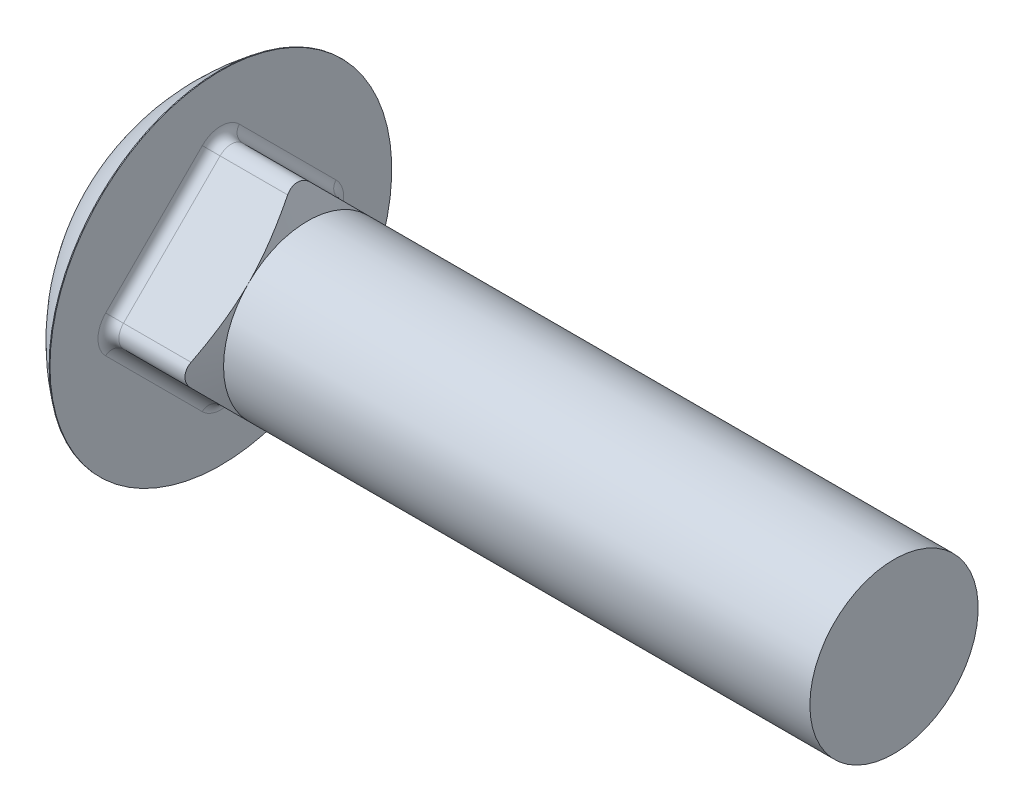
ISO-10303-21;
HEADER;
FILE_DESCRIPTION(('STEP AP214'),'2;1');
FILE_NAME('part.step','',(''),(''),'','','');
FILE_SCHEMA(('AUTOMOTIVE_DESIGN { 1 0 10303 214 1 1 1 1 }'));
ENDSEC;
DATA;
#1=APPLICATION_CONTEXT('core data for automotive mechanical design processes');
#2=APPLICATION_PROTOCOL_DEFINITION('international standard','automotive_design',2000,#1);
#3=PRODUCT_CONTEXT('',#1,'mechanical');
#4=PRODUCT('Part','Part','',(#3));
#5=PRODUCT_RELATED_PRODUCT_CATEGORY('part','',(#4));
#6=PRODUCT_DEFINITION_FORMATION('','',#4);
#7=PRODUCT_DEFINITION_CONTEXT('part definition',#1,'design');
#8=PRODUCT_DEFINITION('design','',#6,#7);
#9=PRODUCT_DEFINITION_SHAPE('','',#8);
#10=(LENGTH_UNIT() NAMED_UNIT(*) SI_UNIT(.MILLI.,.METRE.));
#11=(NAMED_UNIT(*) PLANE_ANGLE_UNIT() SI_UNIT($,.RADIAN.));
#12=(NAMED_UNIT(*) SI_UNIT($,.STERADIAN.) SOLID_ANGLE_UNIT());
#13=UNCERTAINTY_MEASURE_WITH_UNIT(LENGTH_MEASURE(1.E-05),#10,'distance_accuracy_value','');
#14=(GEOMETRIC_REPRESENTATION_CONTEXT(3) GLOBAL_UNCERTAINTY_ASSIGNED_CONTEXT((#13)) GLOBAL_UNIT_ASSIGNED_CONTEXT((#10,
#11,#12)) REPRESENTATION_CONTEXT('',''));
#15=CARTESIAN_POINT('',(0.,0.,0.));
#16=DIRECTION('',(0.,0.,1.));
#17=DIRECTION('',(1.,0.,0.));
#18=AXIS2_PLACEMENT_3D('',#15,#16,#17);
#19=CARTESIAN_POINT('',(26.2128,1.68828815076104,16.2722240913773));
#20=DIRECTION('',(0.,-0.707106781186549,-0.707106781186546));
#21=DIRECTION('',(0.,0.707106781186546,-0.707106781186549));
#22=AXIS2_PLACEMENT_3D('',#19,#20,#21);
#23=PLANE('',#22);
#24=CARTESIAN_POINT('',(24.8807598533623,16.2724240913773,1.68808815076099));
#25=CARTESIAN_POINT('',(24.9601596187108,16.027679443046,1.93283279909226));
#26=CARTESIAN_POINT('',(25.0372964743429,15.7825608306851,2.17795141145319));
#27=CARTESIAN_POINT('',(25.1863519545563,15.2915071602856,2.66900508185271));
#28=CARTESIAN_POINT('',(25.2582700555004,15.0455720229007,2.91494021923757));
#29=CARTESIAN_POINT('',(25.3962596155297,14.5525793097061,3.40793293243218));
#30=CARTESIAN_POINT('',(25.4623241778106,14.3055207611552,3.65499148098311));
#31=CARTESIAN_POINT('',(25.5877245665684,13.8105642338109,4.14994800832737));
#32=CARTESIAN_POINT('',(25.6470605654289,13.5626662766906,4.39784596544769));
#33=CARTESIAN_POINT('',(25.8136481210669,12.8180244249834,5.14248781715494));
#34=CARTESIAN_POINT('',(25.9095878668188,12.3199535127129,5.64055872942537));
#35=CARTESIAN_POINT('',(26.025872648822,11.5708306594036,6.38968158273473));
#36=CARTESIAN_POINT('',(26.0600269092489,11.3208263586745,6.63968588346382));
#37=CARTESIAN_POINT('',(26.1184380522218,10.8202440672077,7.14026817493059));
#38=CARTESIAN_POINT('',(26.142695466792,10.5696661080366,7.39084613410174));
#39=CARTESIAN_POINT('',(26.180348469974,10.073511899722,7.8870003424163));
#40=CARTESIAN_POINT('',(26.1939666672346,9.82794411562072,8.13256812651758));
#41=CARTESIAN_POINT('',(26.2108820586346,9.33663297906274,8.62387926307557));
#42=CARTESIAN_POINT('',(26.2141794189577,9.09088962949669,8.86962261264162));
#43=CARTESIAN_POINT('',(26.2103744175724,8.5994159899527,9.36109625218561));
#44=CARTESIAN_POINT('',(26.2032708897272,8.35368570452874,9.60682653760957));
#45=CARTESIAN_POINT('',(26.1788298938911,7.86247141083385,10.0980408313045));
#46=CARTESIAN_POINT('',(26.1614919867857,7.61698741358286,10.3435248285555));
#47=CARTESIAN_POINT('',(26.1169991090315,7.12672341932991,10.8337888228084));
#48=CARTESIAN_POINT('',(26.0898543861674,6.8819429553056,11.0785692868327));
#49=CARTESIAN_POINT('',(26.026322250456,6.39297863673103,11.5675336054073));
#50=CARTESIAN_POINT('',(25.9899343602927,6.14879481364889,11.8117174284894));
#51=CARTESIAN_POINT('',(25.867943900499,5.41729862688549,12.5432136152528));
#52=CARTESIAN_POINT('',(25.7695138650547,4.93103450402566,13.0294777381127));
#53=CARTESIAN_POINT('',(25.6035912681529,4.21576615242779,13.7447460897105));
#54=CARTESIAN_POINT('',(25.5469072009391,3.98545045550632,13.975061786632));
#55=CARTESIAN_POINT('',(25.4278711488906,3.52559153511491,14.4349207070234));
#56=CARTESIAN_POINT('',(25.3655202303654,3.29604817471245,14.6644640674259));
#57=CARTESIAN_POINT('',(25.2353958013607,2.83637288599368,15.1241393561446));
#58=CARTESIAN_POINT('',(25.1675933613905,2.60624508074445,15.3542671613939));
#59=CARTESIAN_POINT('',(25.0274428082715,2.14666509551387,15.8138471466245));
#60=CARTESIAN_POINT('',(24.955094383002,1.91721296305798,16.0432992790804));
#61=CARTESIAN_POINT('',(24.8807598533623,1.68808815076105,16.2724240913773));
#62=B_SPLINE_CURVE_WITH_KNOTS('',3,(#24,#25,#26,#27,#28,#29,#30,#31,#32,#33,#34,#35,#36,#37,#38,
#39,#40,#41,#42,#43,#44,#45,#46,#47,#48,#49,#50,#51,#52,#53,#54,#55,#56,#57,#58,#59,#60,#61),
.UNSPECIFIED.,.F.,.F.,(4,2,2,2,2,2,2,2,2,2,2,2,2,2,2,2,2,2,4),(0.,1.06534032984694,
2.1307874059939,3.19747357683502,4.26413241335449,6.39581036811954,7.46131492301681,
8.52676219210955,9.56927061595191,10.6117622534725,11.6543707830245,12.6970240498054,
13.7385909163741,14.7802115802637,16.8634229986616,17.8552276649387,18.8468460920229,
19.8441265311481,20.841475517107),.UNSPECIFIED.);
#63=CARTESIAN_POINT('',(24.8808247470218,16.2722240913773,1.68828815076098));
#64=VERTEX_POINT('',#63);
#65=CARTESIAN_POINT('',(26.2128,8.98025612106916,8.98025612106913));
#66=VERTEX_POINT('',#65);
#67=EDGE_CURVE('E58',#64,#66,#62,.T.);
#68=ORIENTED_EDGE('',*,*,#67,.F.);
#69=DIRECTION('',(-1.,0.,0.));
#70=VECTOR('',#69,1.);
#71=CARTESIAN_POINT('',(26.2128,16.2722240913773,1.68828815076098));
#72=LINE('',#71,#70);
#73=CARTESIAN_POINT('',(14.6812,16.2722240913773,1.68828815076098));
#74=VERTEX_POINT('',#73);
#75=EDGE_CURVE('E313',#64,#74,#72,.T.);
#76=ORIENTED_EDGE('',*,*,#75,.T.);
#77=DIRECTION('',(0.,0.707106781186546,-0.707106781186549));
#78=VECTOR('',#77,1.);
#79=CARTESIAN_POINT('',(14.6812,1.68828815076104,16.2722240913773));
#80=LINE('',#79,#78);
#81=CARTESIAN_POINT('',(14.6812,1.68828815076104,16.2722240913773));
#82=VERTEX_POINT('',#81);
#83=EDGE_CURVE('E50',#74,#82,#80,.F.);
#84=ORIENTED_EDGE('',*,*,#83,.T.);
#85=DIRECTION('',(-1.,0.,0.));
#86=VECTOR('',#85,1.);
#87=CARTESIAN_POINT('',(26.2128,1.68828815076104,16.2722240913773));
#88=LINE('',#87,#86);
#89=CARTESIAN_POINT('',(24.8808247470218,1.68828815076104,16.2722240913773));
#90=VERTEX_POINT('',#89);
#91=EDGE_CURVE('E321',#90,#82,#88,.T.);
#92=ORIENTED_EDGE('',*,*,#91,.F.);
#93=EDGE_CURVE('E241',#66,#90,#62,.T.);
#94=ORIENTED_EDGE('',*,*,#93,.F.);
#95=EDGE_LOOP('',(#68,#76,#84,#92,#94));
#96=FACE_BOUND('',#95,.T.);
#97=ADVANCED_FACE('F41',(#96),#23,.F.);
#98=CARTESIAN_POINT('',(26.2128,-16.2722240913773,1.68828815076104));
#99=DIRECTION('',(0.,0.707106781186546,-0.707106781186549));
#100=DIRECTION('',(0.,0.707106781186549,0.707106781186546));
#101=AXIS2_PLACEMENT_3D('',#98,#99,#100);
#102=PLANE('',#101);
#103=CARTESIAN_POINT('',(24.8807598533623,-1.68808815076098,16.2724240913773));
#104=CARTESIAN_POINT('',(24.9601596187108,-1.93283279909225,16.027679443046));
#105=CARTESIAN_POINT('',(25.0372964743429,-2.17795141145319,15.7825608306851));
#106=CARTESIAN_POINT('',(25.1863519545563,-2.6690050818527,15.2915071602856));
#107=CARTESIAN_POINT('',(25.2582700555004,-2.91494021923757,15.0455720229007));
#108=CARTESIAN_POINT('',(25.3962596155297,-3.40793293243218,14.5525793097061));
#109=CARTESIAN_POINT('',(25.4623241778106,-3.65499148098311,14.3055207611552));
#110=CARTESIAN_POINT('',(25.5877245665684,-4.14994800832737,13.8105642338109));
#111=CARTESIAN_POINT('',(25.6470605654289,-4.39784596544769,13.5626662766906));
#112=CARTESIAN_POINT('',(25.8136481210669,-5.14248781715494,12.8180244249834));
#113=CARTESIAN_POINT('',(25.9095878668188,-5.64055872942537,12.3199535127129));
#114=CARTESIAN_POINT('',(26.025872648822,-6.38968158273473,11.5708306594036));
#115=CARTESIAN_POINT('',(26.0600269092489,-6.63968588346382,11.3208263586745));
#116=CARTESIAN_POINT('',(26.1184380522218,-7.14026817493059,10.8202440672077));
#117=CARTESIAN_POINT('',(26.142695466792,-7.39084613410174,10.5696661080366));
#118=CARTESIAN_POINT('',(26.180348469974,-7.8870003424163,10.073511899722));
#119=CARTESIAN_POINT('',(26.1939666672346,-8.13256812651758,9.82794411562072));
#120=CARTESIAN_POINT('',(26.2108820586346,-8.62387926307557,9.33663297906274));
#121=CARTESIAN_POINT('',(26.2141794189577,-8.86962261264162,9.09088962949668));
#122=CARTESIAN_POINT('',(26.2103744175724,-9.36109625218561,8.5994159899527));
#123=CARTESIAN_POINT('',(26.2032708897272,-9.60682653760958,8.35368570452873));
#124=CARTESIAN_POINT('',(26.1788298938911,-10.0980408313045,7.86247141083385));
#125=CARTESIAN_POINT('',(26.1614919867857,-10.3435248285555,7.61698741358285));
#126=CARTESIAN_POINT('',(26.1169991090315,-10.8337888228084,7.12672341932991));
#127=CARTESIAN_POINT('',(26.0898543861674,-11.0785692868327,6.8819429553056));
#128=CARTESIAN_POINT('',(26.026322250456,-11.5675336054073,6.39297863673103));
#129=CARTESIAN_POINT('',(25.9899343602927,-11.8117174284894,6.14879481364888));
#130=CARTESIAN_POINT('',(25.867943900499,-12.5432136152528,5.41729862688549));
#131=CARTESIAN_POINT('',(25.7695138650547,-13.0294777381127,4.93103450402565));
#132=CARTESIAN_POINT('',(25.6035912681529,-13.7447460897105,4.21576615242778));
#133=CARTESIAN_POINT('',(25.5469072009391,-13.975061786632,3.98545045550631));
#134=CARTESIAN_POINT('',(25.4278711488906,-14.4349207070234,3.5255915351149));
#135=CARTESIAN_POINT('',(25.3655202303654,-14.6644640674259,3.29604817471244));
#136=CARTESIAN_POINT('',(25.2353958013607,-15.1241393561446,2.83637288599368));
#137=CARTESIAN_POINT('',(25.1675933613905,-15.3542671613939,2.60624508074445));
#138=CARTESIAN_POINT('',(25.0274428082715,-15.8138471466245,2.14666509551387));
#139=CARTESIAN_POINT('',(24.955094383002,-16.0432992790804,1.91721296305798));
#140=CARTESIAN_POINT('',(24.8807598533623,-16.2724240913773,1.68808815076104));
#141=B_SPLINE_CURVE_WITH_KNOTS('',3,(#103,#104,#105,#106,#107,#108,#109,#110,#111,#112,#113,
#114,#115,#116,#117,#118,#119,#120,#121,#122,#123,#124,#125,#126,#127,#128,#129,#130,#131,#132,
#133,#134,#135,#136,#137,#138,#139,#140),.UNSPECIFIED.,.F.,.F.,(4,2,2,2,2,2,2,2,2,2,2,2,2,2,2,2,
2,2,4),(0.,1.06534032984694,2.1307874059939,3.19747357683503,4.2641324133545,6.39581036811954,
7.46131492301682,8.52676219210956,9.56927061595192,10.6117622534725,11.6543707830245,
12.6970240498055,13.7385909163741,14.7802115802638,16.8634229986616,17.8552276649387,
18.8468460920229,19.8441265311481,20.841475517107),.UNSPECIFIED.);
#142=CARTESIAN_POINT('',(24.8808247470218,-1.68828815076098,16.2722240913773));
#143=VERTEX_POINT('',#142);
#144=CARTESIAN_POINT('',(26.2128,-8.98025612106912,8.98025612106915));
#145=VERTEX_POINT('',#144);
#146=EDGE_CURVE('E143',#143,#145,#141,.T.);
#147=ORIENTED_EDGE('',*,*,#146,.F.);
#148=DIRECTION('',(-1.,0.,0.));
#149=VECTOR('',#148,1.);
#150=CARTESIAN_POINT('',(26.2128,-1.68828815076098,16.2722240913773));
#151=LINE('',#150,#149);
#152=CARTESIAN_POINT('',(14.6812,-1.68828815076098,16.2722240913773));
#153=VERTEX_POINT('',#152);
#154=EDGE_CURVE('E326',#143,#153,#151,.T.);
#155=ORIENTED_EDGE('',*,*,#154,.T.);
#156=DIRECTION('',(0.,0.707106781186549,0.707106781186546));
#157=VECTOR('',#156,1.);
#158=CARTESIAN_POINT('',(14.6812,-16.2722240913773,1.68828815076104));
#159=LINE('',#158,#157);
#160=CARTESIAN_POINT('',(14.6812,-16.2722240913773,1.68828815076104));
#161=VERTEX_POINT('',#160);
#162=EDGE_CURVE('E356',#153,#161,#159,.F.);
#163=ORIENTED_EDGE('',*,*,#162,.T.);
#164=DIRECTION('',(-1.,0.,0.));
#165=VECTOR('',#164,1.);
#166=CARTESIAN_POINT('',(26.2128,-16.2722240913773,1.68828815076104));
#167=LINE('',#166,#165);
#168=CARTESIAN_POINT('',(24.8808247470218,-16.2722240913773,1.68828815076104));
#169=VERTEX_POINT('',#168);
#170=EDGE_CURVE('E178',#169,#161,#167,.T.);
#171=ORIENTED_EDGE('',*,*,#170,.F.);
#172=EDGE_CURVE('E154',#145,#169,#141,.T.);
#173=ORIENTED_EDGE('',*,*,#172,.F.);
#174=EDGE_LOOP('',(#147,#155,#163,#171,#173));
#175=FACE_BOUND('',#174,.T.);
#176=ADVANCED_FACE('F176',(#175),#102,.F.);
#177=CARTESIAN_POINT('',(26.2128,-16.2722240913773,-1.68828815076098));
#178=DIRECTION('',(0.,0.707106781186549,0.707106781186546));
#179=DIRECTION('',(0.,-0.707106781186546,0.707106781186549));
#180=AXIS2_PLACEMENT_3D('',#177,#178,#179);
#181=PLANE('',#180);
#182=CARTESIAN_POINT('',(24.8807598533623,-16.2724240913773,-1.68808815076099));
#183=CARTESIAN_POINT('',(24.9601596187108,-16.027679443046,-1.93283279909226));
#184=CARTESIAN_POINT('',(25.0372964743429,-15.7825608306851,-2.17795141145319));
#185=CARTESIAN_POINT('',(25.1863519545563,-15.2915071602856,-2.66900508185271));
#186=CARTESIAN_POINT('',(25.2582700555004,-15.0455720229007,-2.91494021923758));
#187=CARTESIAN_POINT('',(25.3962596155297,-14.5525793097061,-3.40793293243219));
#188=CARTESIAN_POINT('',(25.4623241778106,-14.3055207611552,-3.65499148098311));
#189=CARTESIAN_POINT('',(25.5877245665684,-13.8105642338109,-4.14994800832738));
#190=CARTESIAN_POINT('',(25.6470605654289,-13.5626662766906,-4.3978459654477));
#191=CARTESIAN_POINT('',(25.8136481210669,-12.8180244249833,-5.14248781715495));
#192=CARTESIAN_POINT('',(25.9095878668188,-12.3199535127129,-5.64055872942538));
#193=CARTESIAN_POINT('',(26.025872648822,-11.5708306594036,-6.38968158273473));
#194=CARTESIAN_POINT('',(26.0600269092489,-11.3208263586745,-6.63968588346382));
#195=CARTESIAN_POINT('',(26.1184380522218,-10.8202440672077,-7.1402681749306));
#196=CARTESIAN_POINT('',(26.142695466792,-10.5696661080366,-7.39084613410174));
#197=CARTESIAN_POINT('',(26.180348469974,-10.073511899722,-7.88700034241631));
#198=CARTESIAN_POINT('',(26.1939666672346,-9.82794411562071,-8.13256812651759));
#199=CARTESIAN_POINT('',(26.2108820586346,-9.33663297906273,-8.62387926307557));
#200=CARTESIAN_POINT('',(26.2141794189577,-9.09088962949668,-8.86962261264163));
#201=CARTESIAN_POINT('',(26.2103744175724,-8.59941598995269,-9.36109625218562));
#202=CARTESIAN_POINT('',(26.2032708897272,-8.35368570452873,-9.60682653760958));
#203=CARTESIAN_POINT('',(26.1788298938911,-7.86247141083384,-10.0980408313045));
#204=CARTESIAN_POINT('',(26.1614919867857,-7.61698741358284,-10.3435248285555));
#205=CARTESIAN_POINT('',(26.1169991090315,-7.12672341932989,-10.8337888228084));
#206=CARTESIAN_POINT('',(26.0898543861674,-6.88194295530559,-11.0785692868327));
#207=CARTESIAN_POINT('',(26.026322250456,-6.39297863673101,-11.5675336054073));
#208=CARTESIAN_POINT('',(25.9899343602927,-6.14879481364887,-11.8117174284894));
#209=CARTESIAN_POINT('',(25.867943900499,-5.41729862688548,-12.5432136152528));
#210=CARTESIAN_POINT('',(25.7695138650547,-4.93103450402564,-13.0294777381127));
#211=CARTESIAN_POINT('',(25.6035912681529,-4.21576615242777,-13.7447460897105));
#212=CARTESIAN_POINT('',(25.5469072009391,-3.9854504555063,-13.975061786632));
#213=CARTESIAN_POINT('',(25.4278711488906,-3.5255915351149,-14.4349207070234));
#214=CARTESIAN_POINT('',(25.3655202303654,-3.29604817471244,-14.6644640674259));
#215=CARTESIAN_POINT('',(25.2353958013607,-2.83637288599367,-15.1241393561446));
#216=CARTESIAN_POINT('',(25.1675933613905,-2.60624508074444,-15.3542671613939));
#217=CARTESIAN_POINT('',(25.0274428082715,-2.14666509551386,-15.8138471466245));
#218=CARTESIAN_POINT('',(24.955094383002,-1.91721296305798,-16.0432992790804));
#219=CARTESIAN_POINT('',(24.8807598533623,-1.68808815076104,-16.2724240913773));
#220=B_SPLINE_CURVE_WITH_KNOTS('',3,(#182,#183,#184,#185,#186,#187,#188,#189,#190,#191,#192,
#193,#194,#195,#196,#197,#198,#199,#200,#201,#202,#203,#204,#205,#206,#207,#208,#209,#210,#211,
#212,#213,#214,#215,#216,#217,#218,#219),.UNSPECIFIED.,.F.,.F.,(4,2,2,2,2,2,2,2,2,2,2,2,2,2,2,2,
2,2,4),(0.,1.06534032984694,2.1307874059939,3.19747357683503,4.2641324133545,6.39581036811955,
7.46131492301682,8.52676219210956,9.56927061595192,10.6117622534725,11.6543707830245,
12.6970240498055,13.7385909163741,14.7802115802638,16.8634229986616,17.8552276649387,
18.8468460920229,19.8441265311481,20.841475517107),.UNSPECIFIED.);
#221=CARTESIAN_POINT('',(24.8808247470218,-16.2722240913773,-1.68828815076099));
#222=VERTEX_POINT('',#221);
#223=CARTESIAN_POINT('',(26.2128,-8.98025612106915,-8.98025612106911));
#224=VERTEX_POINT('',#223);
#225=EDGE_CURVE('E163',#222,#224,#220,.T.);
#226=ORIENTED_EDGE('',*,*,#225,.F.);
#227=DIRECTION('',(-1.,0.,0.));
#228=VECTOR('',#227,1.);
#229=CARTESIAN_POINT('',(26.2128,-16.2722240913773,-1.68828815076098));
#230=LINE('',#229,#228);
#231=CARTESIAN_POINT('',(14.6812,-16.2722240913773,-1.68828815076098));
#232=VERTEX_POINT('',#231);
#233=EDGE_CURVE('E396',#222,#232,#230,.T.);
#234=ORIENTED_EDGE('',*,*,#233,.T.);
#235=DIRECTION('',(0.,-0.707106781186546,0.707106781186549));
#236=VECTOR('',#235,1.);
#237=CARTESIAN_POINT('',(14.6812,-16.2722240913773,-1.68828815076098));
#238=LINE('',#237,#236);
#239=CARTESIAN_POINT('',(14.6812,-1.68828815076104,-16.2722240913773));
#240=VERTEX_POINT('',#239);
#241=EDGE_CURVE('E353',#232,#240,#238,.F.);
#242=ORIENTED_EDGE('',*,*,#241,.T.);
#243=DIRECTION('',(-1.,0.,0.));
#244=VECTOR('',#243,1.);
#245=CARTESIAN_POINT('',(26.2128,-1.68828815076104,-16.2722240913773));
#246=LINE('',#245,#244);
#247=CARTESIAN_POINT('',(24.8808247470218,-1.68828815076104,-16.2722240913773));
#248=VERTEX_POINT('',#247);
#249=EDGE_CURVE('E392',#248,#240,#246,.T.);
#250=ORIENTED_EDGE('',*,*,#249,.F.);
#251=EDGE_CURVE('E227',#224,#248,#220,.T.);
#252=ORIENTED_EDGE('',*,*,#251,.F.);
#253=EDGE_LOOP('',(#226,#234,#242,#250,#252));
#254=FACE_BOUND('',#253,.T.);
#255=ADVANCED_FACE('F310',(#254),#181,.F.);
#256=CARTESIAN_POINT('',(26.2128,1.68828815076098,-16.2722240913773));
#257=DIRECTION('',(0.,-0.707106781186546,0.707106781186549));
#258=DIRECTION('',(0.,-0.707106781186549,-0.707106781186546));
#259=AXIS2_PLACEMENT_3D('',#256,#257,#258);
#260=PLANE('',#259);
#261=CARTESIAN_POINT('',(24.8807598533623,1.68808815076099,-16.2724240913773));
#262=CARTESIAN_POINT('',(24.9601596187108,1.93283279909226,-16.027679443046));
#263=CARTESIAN_POINT('',(25.0372964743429,2.17795141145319,-15.7825608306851));
#264=CARTESIAN_POINT('',(25.1863519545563,2.66900508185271,-15.2915071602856));
#265=CARTESIAN_POINT('',(25.2582700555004,2.91494021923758,-15.0455720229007));
#266=CARTESIAN_POINT('',(25.3962596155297,3.40793293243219,-14.5525793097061));
#267=CARTESIAN_POINT('',(25.4623241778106,3.65499148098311,-14.3055207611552));
#268=CARTESIAN_POINT('',(25.5877245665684,4.14994800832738,-13.8105642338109));
#269=CARTESIAN_POINT('',(25.6470605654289,4.3978459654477,-13.5626662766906));
#270=CARTESIAN_POINT('',(25.8136481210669,5.14248781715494,-12.8180244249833));
#271=CARTESIAN_POINT('',(25.9095878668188,5.64055872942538,-12.3199535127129));
#272=CARTESIAN_POINT('',(26.025872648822,6.38968158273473,-11.5708306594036));
#273=CARTESIAN_POINT('',(26.0600269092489,6.63968588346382,-11.3208263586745));
#274=CARTESIAN_POINT('',(26.1184380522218,7.14026817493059,-10.8202440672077));
#275=CARTESIAN_POINT('',(26.142695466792,7.39084613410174,-10.5696661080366));
#276=CARTESIAN_POINT('',(26.180348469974,7.8870003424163,-10.073511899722));
#277=CARTESIAN_POINT('',(26.1939666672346,8.13256812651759,-9.82794411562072));
#278=CARTESIAN_POINT('',(26.2108820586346,8.62387926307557,-9.33663297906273));
#279=CARTESIAN_POINT('',(26.2141794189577,8.86962261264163,-9.09088962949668));
#280=CARTESIAN_POINT('',(26.2103744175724,9.36109625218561,-8.59941598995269));
#281=CARTESIAN_POINT('',(26.2032708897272,9.60682653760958,-8.35368570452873));
#282=CARTESIAN_POINT('',(26.1788298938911,10.0980408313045,-7.86247141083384));
#283=CARTESIAN_POINT('',(26.1614919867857,10.3435248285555,-7.61698741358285));
#284=CARTESIAN_POINT('',(26.1169991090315,10.8337888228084,-7.1267234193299));
#285=CARTESIAN_POINT('',(26.0898543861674,11.0785692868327,-6.88194295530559));
#286=CARTESIAN_POINT('',(26.026322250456,11.5675336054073,-6.39297863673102));
#287=CARTESIAN_POINT('',(25.9899343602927,11.8117174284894,-6.14879481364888));
#288=CARTESIAN_POINT('',(25.867943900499,12.5432136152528,-5.41729862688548));
#289=CARTESIAN_POINT('',(25.7695138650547,13.0294777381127,-4.93103450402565));
#290=CARTESIAN_POINT('',(25.6035912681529,13.7447460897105,-4.21576615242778));
#291=CARTESIAN_POINT('',(25.5469072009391,13.975061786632,-3.98545045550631));
#292=CARTESIAN_POINT('',(25.4278711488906,14.4349207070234,-3.5255915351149));
#293=CARTESIAN_POINT('',(25.3655202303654,14.6644640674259,-3.29604817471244));
#294=CARTESIAN_POINT('',(25.2353958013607,15.1241393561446,-2.83637288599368));
#295=CARTESIAN_POINT('',(25.1675933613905,15.3542671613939,-2.60624508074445));
#296=CARTESIAN_POINT('',(25.0274428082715,15.8138471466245,-2.14666509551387));
#297=CARTESIAN_POINT('',(24.955094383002,16.0432992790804,-1.91721296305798));
#298=CARTESIAN_POINT('',(24.8807598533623,16.2724240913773,-1.68808815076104));
#299=B_SPLINE_CURVE_WITH_KNOTS('',3,(#261,#262,#263,#264,#265,#266,#267,#268,#269,#270,#271,
#272,#273,#274,#275,#276,#277,#278,#279,#280,#281,#282,#283,#284,#285,#286,#287,#288,#289,#290,
#291,#292,#293,#294,#295,#296,#297,#298),.UNSPECIFIED.,.F.,.F.,(4,2,2,2,2,2,2,2,2,2,2,2,2,2,2,2,
2,2,4),(0.,1.06534032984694,2.1307874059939,3.19747357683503,4.2641324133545,6.39581036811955,
7.46131492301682,8.52676219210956,9.56927061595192,10.6117622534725,11.6543707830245,
12.6970240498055,13.7385909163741,14.7802115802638,16.8634229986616,17.8552276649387,
18.8468460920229,19.8441265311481,20.841475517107),.UNSPECIFIED.);
#300=CARTESIAN_POINT('',(24.8808247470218,1.68828815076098,-16.2722240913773));
#301=VERTEX_POINT('',#300);
#302=CARTESIAN_POINT('',(26.2128,8.98025612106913,-8.98025612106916));
#303=VERTEX_POINT('',#302);
#304=EDGE_CURVE('E66',#301,#303,#299,.T.);
#305=ORIENTED_EDGE('',*,*,#304,.F.);
#306=DIRECTION('',(-1.,0.,0.));
#307=VECTOR('',#306,1.);
#308=CARTESIAN_POINT('',(26.2128,1.68828815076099,-16.2722240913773));
#309=LINE('',#308,#307);
#310=CARTESIAN_POINT('',(14.6812,1.68828815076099,-16.2722240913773));
#311=VERTEX_POINT('',#310);
#312=EDGE_CURVE('E391',#301,#311,#309,.T.);
#313=ORIENTED_EDGE('',*,*,#312,.T.);
#314=DIRECTION('',(0.,-0.707106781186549,-0.707106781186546));
#315=VECTOR('',#314,1.);
#316=CARTESIAN_POINT('',(14.6812,1.68828815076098,-16.2722240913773));
#317=LINE('',#316,#315);
#318=CARTESIAN_POINT('',(14.6812,16.2722240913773,-1.68828815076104));
#319=VERTEX_POINT('',#318);
#320=EDGE_CURVE('E364',#311,#319,#317,.F.);
#321=ORIENTED_EDGE('',*,*,#320,.T.);
#322=DIRECTION('',(-1.,0.,0.));
#323=VECTOR('',#322,1.);
#324=CARTESIAN_POINT('',(26.2128,16.2722240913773,-1.68828815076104));
#325=LINE('',#324,#323);
#326=CARTESIAN_POINT('',(24.8808247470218,16.2722240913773,-1.68828815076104));
#327=VERTEX_POINT('',#326);
#328=EDGE_CURVE('E388',#327,#319,#325,.T.);
#329=ORIENTED_EDGE('',*,*,#328,.F.);
#330=EDGE_CURVE('E179',#303,#327,#299,.T.);
#331=ORIENTED_EDGE('',*,*,#330,.F.);
#332=EDGE_LOOP('',(#305,#313,#321,#329,#331));
#333=FACE_BOUND('',#332,.T.);
#334=ADVANCED_FACE('F208',(#333),#260,.F.);
#335=CARTESIAN_POINT('',(26.2128,14.5839359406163,0.));
#336=DIRECTION('',(-1.,0.,0.));
#337=DIRECTION('',(0.,0.,1.));
#338=AXIS2_PLACEMENT_3D('',#335,#336,#337);
#339=CYLINDRICAL_SURFACE('',#338,2.3876);
#340=CARTESIAN_POINT('',(24.8808896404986,16.2720240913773,-1.68848812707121));
#341=CARTESIAN_POINT('',(24.8660448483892,16.3177753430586,-1.64275670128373));
#342=CARTESIAN_POINT('',(24.851827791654,16.361762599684,-1.59505328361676));
#343=CARTESIAN_POINT('',(24.8247272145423,16.4458829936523,-1.49599546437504));
#344=CARTESIAN_POINT('',(24.8118439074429,16.4860155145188,-1.44464048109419));
#345=CARTESIAN_POINT('',(24.7874879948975,16.5621032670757,-1.33856253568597));
#346=CARTESIAN_POINT('',(24.7760160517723,16.598056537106,-1.28383801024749));
#347=CARTESIAN_POINT('',(24.7545655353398,16.6654497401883,-1.17142448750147));
#348=CARTESIAN_POINT('',(24.7445868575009,16.6968899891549,-1.11373569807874));
#349=CARTESIAN_POINT('',(24.7169641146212,16.7841012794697,-0.936589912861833));
#350=CARTESIAN_POINT('',(24.7016488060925,16.8327143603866,-0.813120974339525));
#351=CARTESIAN_POINT('',(24.6777090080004,16.9088645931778,-0.55937260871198));
#352=CARTESIAN_POINT('',(24.6690801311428,16.9364155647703,-0.429097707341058));
#353=CARTESIAN_POINT('',(24.6588497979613,16.969094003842,-0.168677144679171));
#354=CARTESIAN_POINT('',(24.6570840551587,16.9747456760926,-0.0386039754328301));
#355=CARTESIAN_POINT('',(24.6601779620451,16.9648544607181,0.220660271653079));
#356=CARTESIAN_POINT('',(24.6650378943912,16.9493106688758,0.349851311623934));
#357=CARTESIAN_POINT('',(24.6811547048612,16.8979067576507,0.602126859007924));
#358=CARTESIAN_POINT('',(24.6923368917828,16.8622838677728,0.725264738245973));
#359=CARTESIAN_POINT('',(24.7207581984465,16.7721265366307,0.963690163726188));
#360=CARTESIAN_POINT('',(24.7379980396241,16.71758984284,1.07897677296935));
#361=CARTESIAN_POINT('',(24.7748152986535,16.6017799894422,1.28068997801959));
#362=CARTESIAN_POINT('',(24.7935510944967,16.5430617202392,1.36875489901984));
#363=CARTESIAN_POINT('',(24.8346090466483,16.4151052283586,1.53575852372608));
#364=CARTESIAN_POINT('',(24.8569262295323,16.3458816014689,1.61470962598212));
#365=CARTESIAN_POINT('',(24.8808896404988,16.2720240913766,1.68848812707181));
#366=B_SPLINE_CURVE_WITH_KNOTS('',3,(#340,#341,#342,#343,#344,#345,#346,#347,#348,#349,#350,
#351,#352,#353,#354,#355,#356,#357,#358,#359,#360,#361,#362,#363,#364,#365),.UNSPECIFIED.,.F.,
.F.,(4,2,2,2,2,2,2,2,2,2,2,2,4),(0.,0.199055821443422,0.398143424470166,0.597324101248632,
0.796490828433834,1.195074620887,1.59339666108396,1.9821229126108,2.37086574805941,
2.75510915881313,3.13939834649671,3.46092525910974,3.78200947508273),.UNSPECIFIED.);
#367=EDGE_CURVE('E235',#327,#64,#366,.T.);
#368=ORIENTED_EDGE('',*,*,#367,.F.);
#369=ORIENTED_EDGE('',*,*,#328,.T.);
#370=CARTESIAN_POINT('',(14.6812,14.5839359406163,0.));
#371=DIRECTION('',(1.,0.,0.));
#372=DIRECTION('',(0.,0.,-1.));
#373=AXIS2_PLACEMENT_3D('',#370,#371,#372);
#374=CIRCLE('',#373,2.3876);
#375=EDGE_CURVE('E11',#319,#74,#374,.T.);
#376=ORIENTED_EDGE('',*,*,#375,.T.);
#377=ORIENTED_EDGE('',*,*,#75,.F.);
#378=EDGE_LOOP('',(#368,#369,#376,#377));
#379=FACE_BOUND('',#378,.T.);
#380=ADVANCED_FACE('F248',(#379),#339,.T.);
#381=CARTESIAN_POINT('',(26.2128,0.,14.5839359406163));
#382=DIRECTION('',(-1.,0.,0.));
#383=DIRECTION('',(0.,0.,1.));
#384=AXIS2_PLACEMENT_3D('',#381,#382,#383);
#385=CYLINDRICAL_SURFACE('',#384,2.3876);
#386=CARTESIAN_POINT('',(24.880889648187,1.68848815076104,16.2720240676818));
#387=CARTESIAN_POINT('',(24.8660448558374,1.64275672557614,16.3177753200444));
#388=CARTESIAN_POINT('',(24.8518277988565,1.59505330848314,16.3617625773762));
#389=CARTESIAN_POINT('',(24.8247272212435,1.49599549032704,16.445882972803));
#390=CARTESIAN_POINT('',(24.8118439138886,1.4446405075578,16.4860154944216));
#391=CARTESIAN_POINT('',(24.7874880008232,1.33856256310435,16.5621032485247));
#392=CARTESIAN_POINT('',(24.7760160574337,1.28383803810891,16.5980565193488));
#393=CARTESIAN_POINT('',(24.7545655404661,1.17142451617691,16.6654497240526));
#394=CARTESIAN_POINT('',(24.7445868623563,1.11373572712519,16.6968899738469));
#395=CARTESIAN_POINT('',(24.7169641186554,0.936589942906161,16.7841012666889));
#396=CARTESIAN_POINT('',(24.7016488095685,0.813121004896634,16.8327143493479));
#397=CARTESIAN_POINT('',(24.6777090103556,0.559372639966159,16.908864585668));
#398=CARTESIAN_POINT('',(24.6690801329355,0.429097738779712,16.9364155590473));
#399=CARTESIAN_POINT('',(24.658849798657,0.168677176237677,16.9690940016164));
#400=CARTESIAN_POINT('',(24.6570840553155,0.0386040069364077,16.9747456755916));
#401=CARTESIAN_POINT('',(24.6601779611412,-0.2206602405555,16.9648544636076));
#402=CARTESIAN_POINT('',(24.6650378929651,-0.349851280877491,16.9493106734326));
#403=CARTESIAN_POINT('',(24.6811547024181,-0.602126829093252,16.8979067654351));
#404=CARTESIAN_POINT('',(24.6923368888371,-0.725264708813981,16.8622838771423));
#405=CARTESIAN_POINT('',(24.7207581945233,-0.963690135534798,16.7721265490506));
#406=CARTESIAN_POINT('',(24.7379980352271,-1.07897674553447,16.7175898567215));
#407=CARTESIAN_POINT('',(24.774815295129,-1.28068996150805,16.6017800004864));
#408=CARTESIAN_POINT('',(24.7935510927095,-1.36875489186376,16.5430617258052));
#409=CARTESIAN_POINT('',(24.8346090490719,-1.53575853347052,16.4151052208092));
#410=CARTESIAN_POINT('',(24.8569262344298,-1.61470964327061,16.3458815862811));
#411=CARTESIAN_POINT('',(24.880889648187,-1.68848815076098,16.2720240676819));
#412=B_SPLINE_CURVE_WITH_KNOTS('',3,(#386,#387,#388,#389,#390,#391,#392,#393,#394,#395,#396,
#397,#398,#399,#400,#401,#402,#403,#404,#405,#406,#407,#408,#409,#410,#411),.UNSPECIFIED.,.F.,
.F.,(4,2,2,2,2,2,2,2,2,2,2,2,4),(0.,0.199055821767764,0.398143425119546,0.597324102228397,
0.796490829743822,1.19507462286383,1.59339666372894,1.98212291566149,2.37086575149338,
2.75510916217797,3.1393983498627,3.46092529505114,3.78200954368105),.UNSPECIFIED.);
#413=EDGE_CURVE('E150',#90,#143,#412,.T.);
#414=ORIENTED_EDGE('',*,*,#413,.F.);
#415=ORIENTED_EDGE('',*,*,#91,.T.);
#416=CARTESIAN_POINT('',(14.6812,0.,14.5839359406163));
#417=DIRECTION('',(1.,0.,0.));
#418=DIRECTION('',(0.,0.,-1.));
#419=AXIS2_PLACEMENT_3D('',#416,#417,#418);
#420=CIRCLE('',#419,2.3876);
#421=EDGE_CURVE('E361',#82,#153,#420,.T.);
#422=ORIENTED_EDGE('',*,*,#421,.T.);
#423=ORIENTED_EDGE('',*,*,#154,.F.);
#424=EDGE_LOOP('',(#414,#415,#422,#423));
#425=FACE_BOUND('',#424,.T.);
#426=ADVANCED_FACE('F252',(#425),#385,.T.);
#427=CARTESIAN_POINT('',(26.2128,-14.5839359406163,0.));
#428=DIRECTION('',(-1.,0.,0.));
#429=DIRECTION('',(0.,0.,1.));
#430=AXIS2_PLACEMENT_3D('',#427,#428,#429);
#431=CYLINDRICAL_SURFACE('',#430,2.3876);
#432=CARTESIAN_POINT('',(24.8808896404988,-16.2720240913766,1.68848812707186));
#433=CARTESIAN_POINT('',(24.8660448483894,-16.317775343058,1.64275670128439));
#434=CARTESIAN_POINT('',(24.8518277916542,-16.3617625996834,1.59505328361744));
#435=CARTESIAN_POINT('',(24.8247272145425,-16.4458829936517,1.49599546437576));
#436=CARTESIAN_POINT('',(24.8118439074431,-16.4860155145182,1.44464048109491));
#437=CARTESIAN_POINT('',(24.7874879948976,-16.5621032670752,1.33856253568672));
#438=CARTESIAN_POINT('',(24.7760160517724,-16.5980565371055,1.28383801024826));
#439=CARTESIAN_POINT('',(24.75456553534,-16.6654497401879,1.17142448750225));
#440=CARTESIAN_POINT('',(24.744586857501,-16.6968899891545,1.11373569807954));
#441=CARTESIAN_POINT('',(24.7169641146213,-16.7841012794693,0.936589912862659));
#442=CARTESIAN_POINT('',(24.7016488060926,-16.8327143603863,0.813120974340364));
#443=CARTESIAN_POINT('',(24.6777090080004,-16.9088645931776,0.559372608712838));
#444=CARTESIAN_POINT('',(24.6690801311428,-16.9364155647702,0.429097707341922));
#445=CARTESIAN_POINT('',(24.6588497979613,-16.9690940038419,0.168677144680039));
#446=CARTESIAN_POINT('',(24.6570840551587,-16.9747456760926,0.0386039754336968));
#447=CARTESIAN_POINT('',(24.6601779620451,-16.9648544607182,-0.220660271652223));
#448=CARTESIAN_POINT('',(24.6650378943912,-16.9493106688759,-0.349851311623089));
#449=CARTESIAN_POINT('',(24.6811547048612,-16.897906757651,-0.602126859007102));
#450=CARTESIAN_POINT('',(24.6923368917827,-16.8622838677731,-0.725264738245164));
#451=CARTESIAN_POINT('',(24.7207581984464,-16.772126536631,-0.963690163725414));
#452=CARTESIAN_POINT('',(24.737998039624,-16.7175898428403,-1.0789767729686));
#453=CARTESIAN_POINT('',(24.7748152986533,-16.6017799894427,-1.28068997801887));
#454=CARTESIAN_POINT('',(24.7935510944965,-16.5430617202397,-1.36875489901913));
#455=CARTESIAN_POINT('',(24.8346090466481,-16.4151052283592,-1.53575852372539));
#456=CARTESIAN_POINT('',(24.8569262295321,-16.3458816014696,-1.61470962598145));
#457=CARTESIAN_POINT('',(24.8808896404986,-16.2720240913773,-1.68848812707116));
#458=B_SPLINE_CURVE_WITH_KNOTS('',3,(#432,#433,#434,#435,#436,#437,#438,#439,#440,#441,#442,
#443,#444,#445,#446,#447,#448,#449,#450,#451,#452,#453,#454,#455,#456,#457),.UNSPECIFIED.,.F.,
.F.,(4,2,2,2,2,2,2,2,2,2,2,2,4),(0.,0.199055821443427,0.398143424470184,0.597324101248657,
0.796490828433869,1.19507462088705,1.59339666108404,1.98212291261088,2.3708657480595,
2.75510915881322,3.1393983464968,3.46092525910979,3.78200947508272),.UNSPECIFIED.);
#459=EDGE_CURVE('E180',#169,#222,#458,.T.);
#460=ORIENTED_EDGE('',*,*,#459,.F.);
#461=ORIENTED_EDGE('',*,*,#170,.T.);
#462=CARTESIAN_POINT('',(14.6812,-14.5839359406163,0.));
#463=DIRECTION('',(1.,0.,0.));
#464=DIRECTION('',(0.,0.,-1.));
#465=AXIS2_PLACEMENT_3D('',#462,#463,#464);
#466=CIRCLE('',#465,2.3876);
#467=EDGE_CURVE('E167',#161,#232,#466,.T.);
#468=ORIENTED_EDGE('',*,*,#467,.T.);
#469=ORIENTED_EDGE('',*,*,#233,.F.);
#470=EDGE_LOOP('',(#460,#461,#468,#469));
#471=FACE_BOUND('',#470,.T.);
#472=ADVANCED_FACE('F411',(#471),#431,.T.);
#473=CARTESIAN_POINT('',(26.2128,0.,-14.5839359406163));
#474=DIRECTION('',(-1.,0.,0.));
#475=DIRECTION('',(0.,0.,1.));
#476=AXIS2_PLACEMENT_3D('',#473,#474,#475);
#477=CYLINDRICAL_SURFACE('',#476,2.3876);
#478=CARTESIAN_POINT('',(24.880889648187,-1.68848815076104,-16.2720240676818));
#479=CARTESIAN_POINT('',(24.8660448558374,-1.64275672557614,-16.3177753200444));
#480=CARTESIAN_POINT('',(24.8518277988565,-1.59505330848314,-16.3617625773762));
#481=CARTESIAN_POINT('',(24.8247272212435,-1.49599549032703,-16.445882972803));
#482=CARTESIAN_POINT('',(24.8118439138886,-1.4446405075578,-16.4860154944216));
#483=CARTESIAN_POINT('',(24.7874880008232,-1.33856256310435,-16.5621032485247));
#484=CARTESIAN_POINT('',(24.7760160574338,-1.28383803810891,-16.5980565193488));
#485=CARTESIAN_POINT('',(24.7545655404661,-1.17142451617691,-16.6654497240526));
#486=CARTESIAN_POINT('',(24.7445868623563,-1.11373572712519,-16.6968899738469));
#487=CARTESIAN_POINT('',(24.7169641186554,-0.936589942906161,-16.7841012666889));
#488=CARTESIAN_POINT('',(24.7016488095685,-0.813121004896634,-16.8327143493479));
#489=CARTESIAN_POINT('',(24.6777090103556,-0.559372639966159,-16.908864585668));
#490=CARTESIAN_POINT('',(24.6690801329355,-0.429097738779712,-16.9364155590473));
#491=CARTESIAN_POINT('',(24.658849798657,-0.168677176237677,-16.9690940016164));
#492=CARTESIAN_POINT('',(24.6570840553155,-0.0386040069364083,-16.9747456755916));
#493=CARTESIAN_POINT('',(24.6601779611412,0.220660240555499,-16.9648544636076));
#494=CARTESIAN_POINT('',(24.6650378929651,0.34985128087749,-16.9493106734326));
#495=CARTESIAN_POINT('',(24.6811547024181,0.602126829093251,-16.8979067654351));
#496=CARTESIAN_POINT('',(24.6923368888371,0.72526470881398,-16.8622838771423));
#497=CARTESIAN_POINT('',(24.7207581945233,0.963690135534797,-16.7721265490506));
#498=CARTESIAN_POINT('',(24.7379980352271,1.07897674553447,-16.7175898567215));
#499=CARTESIAN_POINT('',(24.774815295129,1.28068996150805,-16.6017800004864));
#500=CARTESIAN_POINT('',(24.7935510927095,1.36875489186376,-16.5430617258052));
#501=CARTESIAN_POINT('',(24.8346090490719,1.53575853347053,-16.4151052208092));
#502=CARTESIAN_POINT('',(24.8569262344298,1.61470964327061,-16.3458815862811));
#503=CARTESIAN_POINT('',(24.880889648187,1.68848815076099,-16.2720240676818));
#504=B_SPLINE_CURVE_WITH_KNOTS('',3,(#478,#479,#480,#481,#482,#483,#484,#485,#486,#487,#488,
#489,#490,#491,#492,#493,#494,#495,#496,#497,#498,#499,#500,#501,#502,#503),.UNSPECIFIED.,.F.,
.F.,(4,2,2,2,2,2,2,2,2,2,2,2,4),(0.,0.199055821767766,0.398143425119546,0.597324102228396,
0.796490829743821,1.19507462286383,1.59339666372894,1.98212291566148,2.37086575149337,
2.75510916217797,3.1393983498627,3.46092529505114,3.78200954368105),.UNSPECIFIED.);
#505=EDGE_CURVE('E214',#248,#301,#504,.T.);
#506=ORIENTED_EDGE('',*,*,#505,.F.);
#507=ORIENTED_EDGE('',*,*,#249,.T.);
#508=CARTESIAN_POINT('',(14.6812,0.,-14.5839359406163));
#509=DIRECTION('',(1.,0.,0.));
#510=DIRECTION('',(0.,0.,-1.));
#511=AXIS2_PLACEMENT_3D('',#508,#509,#510);
#512=CIRCLE('',#511,2.3876);
#513=EDGE_CURVE('E358',#240,#311,#512,.T.);
#514=ORIENTED_EDGE('',*,*,#513,.T.);
#515=ORIENTED_EDGE('',*,*,#312,.F.);
#516=EDGE_LOOP('',(#506,#507,#514,#515));
#517=FACE_BOUND('',#516,.T.);
#518=ADVANCED_FACE('F263',(#517),#477,.T.);
#519=CARTESIAN_POINT('',(13.1064,25.7937,0.));
#520=DIRECTION('',(1.,0.,0.));
#521=DIRECTION('',(0.,0.,-1.));
#522=AXIS2_PLACEMENT_3D('',#519,#520,#521);
#523=PLANE('',#522);
#524=DIRECTION('',(0.,-0.707106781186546,0.707106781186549));
#525=VECTOR('',#524,1.);
#526=CARTESIAN_POINT('',(13.1064,2.80304211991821,-22.9906578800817));
#527=LINE('',#526,#525);
#528=CARTESIAN_POINT('',(13.1064,-2.80183990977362,-17.3857758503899));
#529=VERTEX_POINT('',#528);
#530=CARTESIAN_POINT('',(13.1064,-17.3857758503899,-2.80183990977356));
#531=VERTEX_POINT('',#530);
#532=EDGE_CURVE('E348',#529,#531,#527,.T.);
#533=ORIENTED_EDGE('',*,*,#532,.T.);
#534=CARTESIAN_POINT('',(13.1064,-14.5839359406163,0.));
#535=DIRECTION('',(1.,0.,0.));
#536=DIRECTION('',(0.,0.,-1.));
#537=AXIS2_PLACEMENT_3D('',#534,#535,#536);
#538=CIRCLE('',#537,3.9624);
#539=CARTESIAN_POINT('',(13.1064,-17.3857758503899,2.80183990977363));
#540=VERTEX_POINT('',#539);
#541=EDGE_CURVE('E350',#531,#540,#538,.F.);
#542=ORIENTED_EDGE('',*,*,#541,.T.);
#543=DIRECTION('',(0.,0.707106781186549,0.707106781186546));
#544=VECTOR('',#543,1.);
#545=CARTESIAN_POINT('',(13.1064,2.80304211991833,22.9906578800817));
#546=LINE('',#545,#544);
#547=CARTESIAN_POINT('',(13.1064,-2.80183990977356,17.3857758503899));
#548=VERTEX_POINT('',#547);
#549=EDGE_CURVE('E346',#540,#548,#546,.T.);
#550=ORIENTED_EDGE('',*,*,#549,.T.);
#551=CARTESIAN_POINT('',(13.1064,0.,14.5839359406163));
#552=DIRECTION('',(1.,0.,0.));
#553=DIRECTION('',(0.,0.,-1.));
#554=AXIS2_PLACEMENT_3D('',#551,#552,#553);
#555=CIRCLE('',#554,3.9624);
#556=CARTESIAN_POINT('',(13.1064,2.80183990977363,17.3857758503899));
#557=VERTEX_POINT('',#556);
#558=EDGE_CURVE('E342',#548,#557,#555,.F.);
#559=ORIENTED_EDGE('',*,*,#558,.T.);
#560=DIRECTION('',(0.,0.707106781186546,-0.707106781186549));
#561=VECTOR('',#560,1.);
#562=CARTESIAN_POINT('',(13.1064,22.9906578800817,-2.80304211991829));
#563=LINE('',#562,#561);
#564=CARTESIAN_POINT('',(13.1064,17.3857758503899,2.80183990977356));
#565=VERTEX_POINT('',#564);
#566=EDGE_CURVE('E338',#557,#565,#563,.T.);
#567=ORIENTED_EDGE('',*,*,#566,.T.);
#568=CARTESIAN_POINT('',(13.1064,14.5839359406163,0.));
#569=DIRECTION('',(1.,0.,0.));
#570=DIRECTION('',(0.,0.,-1.));
#571=AXIS2_PLACEMENT_3D('',#568,#569,#570);
#572=CIRCLE('',#571,3.9624);
#573=CARTESIAN_POINT('',(13.1064,17.3857758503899,-2.80183990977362));
#574=VERTEX_POINT('',#573);
#575=EDGE_CURVE('E336',#565,#574,#572,.F.);
#576=ORIENTED_EDGE('',*,*,#575,.T.);
#577=DIRECTION('',(0.,-0.707106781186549,-0.707106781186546));
#578=VECTOR('',#577,1.);
#579=CARTESIAN_POINT('',(13.1064,22.9906578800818,2.80304211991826));
#580=LINE('',#579,#578);
#581=CARTESIAN_POINT('',(13.1064,2.80183990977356,-17.3857758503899));
#582=VERTEX_POINT('',#581);
#583=EDGE_CURVE('E340',#574,#582,#580,.T.);
#584=ORIENTED_EDGE('',*,*,#583,.T.);
#585=CARTESIAN_POINT('',(13.1064,0.,-14.5839359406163));
#586=DIRECTION('',(1.,0.,0.));
#587=DIRECTION('',(0.,0.,-1.));
#588=AXIS2_PLACEMENT_3D('',#585,#586,#587);
#589=CIRCLE('',#588,3.9624);
#590=EDGE_CURVE('E344',#582,#529,#589,.F.);
#591=ORIENTED_EDGE('',*,*,#590,.T.);
#592=EDGE_LOOP('',(#533,#542,#550,#559,#567,#576,#584,#591));
#593=FACE_BOUND('',#592,.T.);
#594=CARTESIAN_POINT('',(13.1064,0.,0.));
#595=DIRECTION('',(-1.,0.,0.));
#596=DIRECTION('',(0.,0.,1.));
#597=AXIS2_PLACEMENT_3D('',#594,#595,#596);
#598=CIRCLE('',#597,25.7937);
#599=CARTESIAN_POINT('',(13.1064,0.,25.7937));
#600=VERTEX_POINT('',#599);
#601=EDGE_CURVE('E324',#600,#600,#598,.T.);
#602=ORIENTED_EDGE('',*,*,#601,.F.);
#603=EDGE_LOOP('',(#602));
#604=FACE_BOUND('',#603,.T.);
#605=ADVANCED_FACE('F260',(#593,#604),#523,.T.);
#606=CARTESIAN_POINT('',(32.1193500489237,0.,0.));
#607=DIRECTION('',(-1.,0.,0.));
#608=DIRECTION('',(0.,1.,0.));
#609=AXIS2_PLACEMENT_3D('',#606,#607,#608);
#610=SPHERICAL_SURFACE('',#609,32.1193500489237);
#611=CARTESIAN_POINT('',(12.9794,0.,0.));
#612=DIRECTION('',(-1.,0.,0.));
#613=DIRECTION('',(0.,0.,1.));
#614=AXIS2_PLACEMENT_3D('',#611,#612,#613);
#615=CIRCLE('',#614,25.7937);
#616=CARTESIAN_POINT('',(12.9794,0.,25.7937));
#617=VERTEX_POINT('',#616);
#618=EDGE_CURVE('E320',#617,#617,#615,.T.);
#619=ORIENTED_EDGE('',*,*,#618,.T.);
#620=EDGE_LOOP('',(#619));
#621=FACE_BOUND('',#620,.T.);
#622=ADVANCED_FACE('F258',(#621),#610,.T.);
#623=CARTESIAN_POINT('',(0.,0.,0.));
#624=DIRECTION('',(-1.,0.,0.));
#625=DIRECTION('',(0.,0.,1.));
#626=AXIS2_PLACEMENT_3D('',#623,#624,#625);
#627=CYLINDRICAL_SURFACE('',#626,25.7937);
#628=ORIENTED_EDGE('',*,*,#618,.F.);
#629=EDGE_LOOP('',(#628));
#630=FACE_BOUND('',#629,.T.);
#631=ORIENTED_EDGE('',*,*,#601,.T.);
#632=EDGE_LOOP('',(#631));
#633=FACE_BOUND('',#632,.T.);
#634=ADVANCED_FACE('F255',(#630,#633),#627,.T.);
#635=CARTESIAN_POINT('',(14.6812,14.5839359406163,0.));
#636=DIRECTION('',(1.,0.,0.));
#637=DIRECTION('',(0.,0.,-1.));
#638=AXIS2_PLACEMENT_3D('',#635,#636,#637);
#639=TOROIDAL_SURFACE('',#638,3.9624,1.5748);
#640=CARTESIAN_POINT('',(14.6812,17.3857758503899,-2.80183990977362));
#641=DIRECTION('',(0.,0.707106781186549,0.707106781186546));
#642=DIRECTION('',(0.,-0.707106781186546,0.707106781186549));
#643=AXIS2_PLACEMENT_3D('',#640,#641,#642);
#644=CIRCLE('',#643,1.5748);
#645=EDGE_CURVE('E383',#574,#319,#644,.T.);
#646=ORIENTED_EDGE('',*,*,#645,.F.);
#647=ORIENTED_EDGE('',*,*,#575,.F.);
#648=CARTESIAN_POINT('',(14.6812,17.3857758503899,2.80183990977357));
#649=DIRECTION('',(0.,0.707106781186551,-0.707106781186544));
#650=DIRECTION('',(0.,0.707106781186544,0.707106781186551));
#651=AXIS2_PLACEMENT_3D('',#648,#649,#650);
#652=CIRCLE('',#651,1.5748);
#653=EDGE_CURVE('E45',#74,#565,#652,.T.);
#654=ORIENTED_EDGE('',*,*,#653,.F.);
#655=ORIENTED_EDGE('',*,*,#375,.F.);
#656=EDGE_LOOP('',(#646,#647,#654,#655));
#657=FACE_BOUND('',#656,.T.);
#658=ADVANCED_FACE('F43',(#657),#639,.F.);
#659=CARTESIAN_POINT('',(14.6812,22.9906578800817,-2.80304211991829));
#660=DIRECTION('',(0.,0.707106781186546,-0.707106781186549));
#661=DIRECTION('',(0.,0.707106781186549,0.707106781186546));
#662=AXIS2_PLACEMENT_3D('',#659,#660,#661);
#663=CYLINDRICAL_SURFACE('',#662,1.5748);
#664=ORIENTED_EDGE('',*,*,#653,.T.);
#665=ORIENTED_EDGE('',*,*,#566,.F.);
#666=CARTESIAN_POINT('',(14.6812,2.80183990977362,17.3857758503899));
#667=DIRECTION('',(0.,0.707106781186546,-0.707106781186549));
#668=DIRECTION('',(0.,0.707106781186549,0.707106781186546));
#669=AXIS2_PLACEMENT_3D('',#666,#667,#668);
#670=CIRCLE('',#669,1.5748);
#671=EDGE_CURVE('E381',#82,#557,#670,.T.);
#672=ORIENTED_EDGE('',*,*,#671,.F.);
#673=ORIENTED_EDGE('',*,*,#83,.F.);
#674=EDGE_LOOP('',(#664,#665,#672,#673));
#675=FACE_BOUND('',#674,.T.);
#676=ADVANCED_FACE('F296',(#675),#663,.F.);
#677=CARTESIAN_POINT('',(14.6812,22.9906578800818,2.80304211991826));
#678=DIRECTION('',(0.,-0.707106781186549,-0.707106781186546));
#679=DIRECTION('',(0.,0.707106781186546,-0.707106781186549));
#680=AXIS2_PLACEMENT_3D('',#677,#678,#679);
#681=CYLINDRICAL_SURFACE('',#680,1.5748);
#682=ORIENTED_EDGE('',*,*,#645,.T.);
#683=ORIENTED_EDGE('',*,*,#320,.F.);
#684=CARTESIAN_POINT('',(14.6812,2.80183990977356,-17.3857758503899));
#685=DIRECTION('',(0.,0.707106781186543,0.707106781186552));
#686=DIRECTION('',(0.,-0.707106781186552,0.707106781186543));
#687=AXIS2_PLACEMENT_3D('',#684,#685,#686);
#688=CIRCLE('',#687,1.5748);
#689=EDGE_CURVE('E378',#582,#311,#688,.T.);
#690=ORIENTED_EDGE('',*,*,#689,.F.);
#691=ORIENTED_EDGE('',*,*,#583,.F.);
#692=EDGE_LOOP('',(#682,#683,#690,#691));
#693=FACE_BOUND('',#692,.T.);
#694=ADVANCED_FACE('F293',(#693),#681,.F.);
#695=CARTESIAN_POINT('',(14.6812,0.,14.5839359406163));
#696=DIRECTION('',(1.,0.,0.));
#697=DIRECTION('',(0.,0.,-1.));
#698=AXIS2_PLACEMENT_3D('',#695,#696,#697);
#699=TOROIDAL_SURFACE('',#698,3.9624,1.5748);
#700=ORIENTED_EDGE('',*,*,#671,.T.);
#701=ORIENTED_EDGE('',*,*,#558,.F.);
#702=CARTESIAN_POINT('',(14.6812,-2.80183990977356,17.3857758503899));
#703=DIRECTION('',(0.,0.707106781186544,0.707106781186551));
#704=DIRECTION('',(0.,-0.707106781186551,0.707106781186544));
#705=AXIS2_PLACEMENT_3D('',#702,#703,#704);
#706=CIRCLE('',#705,1.5748);
#707=EDGE_CURVE('E375',#153,#548,#706,.T.);
#708=ORIENTED_EDGE('',*,*,#707,.F.);
#709=ORIENTED_EDGE('',*,*,#421,.F.);
#710=EDGE_LOOP('',(#700,#701,#708,#709));
#711=FACE_BOUND('',#710,.T.);
#712=ADVANCED_FACE('F289',(#711),#699,.F.);
#713=CARTESIAN_POINT('',(14.6812,0.,-14.5839359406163));
#714=DIRECTION('',(1.,0.,0.));
#715=DIRECTION('',(0.,0.,-1.));
#716=AXIS2_PLACEMENT_3D('',#713,#714,#715);
#717=TOROIDAL_SURFACE('',#716,3.9624,1.5748);
#718=ORIENTED_EDGE('',*,*,#689,.T.);
#719=ORIENTED_EDGE('',*,*,#513,.F.);
#720=CARTESIAN_POINT('',(14.6812,-2.80183990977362,-17.3857758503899));
#721=DIRECTION('',(0.,0.707106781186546,-0.707106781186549));
#722=DIRECTION('',(0.,0.707106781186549,0.707106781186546));
#723=AXIS2_PLACEMENT_3D('',#720,#721,#722);
#724=CIRCLE('',#723,1.5748);
#725=EDGE_CURVE('E372',#529,#240,#724,.T.);
#726=ORIENTED_EDGE('',*,*,#725,.F.);
#727=ORIENTED_EDGE('',*,*,#590,.F.);
#728=EDGE_LOOP('',(#718,#719,#726,#727));
#729=FACE_BOUND('',#728,.T.);
#730=ADVANCED_FACE('F285',(#729),#717,.F.);
#731=CARTESIAN_POINT('',(14.6812,2.80304211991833,22.9906578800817));
#732=DIRECTION('',(0.,0.707106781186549,0.707106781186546));
#733=DIRECTION('',(0.,-0.707106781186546,0.707106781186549));
#734=AXIS2_PLACEMENT_3D('',#731,#732,#733);
#735=CYLINDRICAL_SURFACE('',#734,1.5748);
#736=ORIENTED_EDGE('',*,*,#707,.T.);
#737=ORIENTED_EDGE('',*,*,#549,.F.);
#738=CARTESIAN_POINT('',(14.6812,-17.3857758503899,2.80183990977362));
#739=DIRECTION('',(0.,0.707106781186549,0.707106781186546));
#740=DIRECTION('',(0.,-0.707106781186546,0.707106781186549));
#741=AXIS2_PLACEMENT_3D('',#738,#739,#740);
#742=CIRCLE('',#741,1.5748);
#743=EDGE_CURVE('E370',#161,#540,#742,.T.);
#744=ORIENTED_EDGE('',*,*,#743,.F.);
#745=ORIENTED_EDGE('',*,*,#162,.F.);
#746=EDGE_LOOP('',(#736,#737,#744,#745));
#747=FACE_BOUND('',#746,.T.);
#748=ADVANCED_FACE('F281',(#747),#735,.F.);
#749=CARTESIAN_POINT('',(14.6812,2.80304211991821,-22.9906578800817));
#750=DIRECTION('',(0.,-0.707106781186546,0.707106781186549));
#751=DIRECTION('',(0.,-0.707106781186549,-0.707106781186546));
#752=AXIS2_PLACEMENT_3D('',#749,#750,#751);
#753=CYLINDRICAL_SURFACE('',#752,1.5748);
#754=ORIENTED_EDGE('',*,*,#725,.T.);
#755=ORIENTED_EDGE('',*,*,#241,.F.);
#756=CARTESIAN_POINT('',(14.6812,-17.3857758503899,-2.80183990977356));
#757=DIRECTION('',(0.,0.707106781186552,-0.707106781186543));
#758=DIRECTION('',(0.,0.707106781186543,0.707106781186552));
#759=AXIS2_PLACEMENT_3D('',#756,#757,#758);
#760=CIRCLE('',#759,1.5748);
#761=EDGE_CURVE('E315',#531,#232,#760,.T.);
#762=ORIENTED_EDGE('',*,*,#761,.F.);
#763=ORIENTED_EDGE('',*,*,#532,.F.);
#764=EDGE_LOOP('',(#754,#755,#762,#763));
#765=FACE_BOUND('',#764,.T.);
#766=ADVANCED_FACE('F277',(#765),#753,.F.);
#767=CARTESIAN_POINT('',(14.6812,-14.5839359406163,0.));
#768=DIRECTION('',(1.,0.,0.));
#769=DIRECTION('',(0.,0.,-1.));
#770=AXIS2_PLACEMENT_3D('',#767,#768,#769);
#771=TOROIDAL_SURFACE('',#770,3.9624,1.5748);
#772=ORIENTED_EDGE('',*,*,#743,.T.);
#773=ORIENTED_EDGE('',*,*,#541,.F.);
#774=ORIENTED_EDGE('',*,*,#761,.T.);
#775=ORIENTED_EDGE('',*,*,#467,.F.);
#776=EDGE_LOOP('',(#772,#773,#774,#775));
#777=FACE_BOUND('',#776,.T.);
#778=ADVANCED_FACE('F274',(#777),#771,.F.);
#779=CARTESIAN_POINT('',(16.8246609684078,0.,0.));
#780=DIRECTION('',(-1.,0.,0.));
#781=DIRECTION('',(0.,-1.,0.));
#782=AXIS2_PLACEMENT_3D('',#779,#780,#781);
#783=CONICAL_SURFACE('',#782,38.4937,1.22173047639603);
#784=ORIENTED_EDGE('',*,*,#172,.T.);
#785=ORIENTED_EDGE('',*,*,#459,.T.);
#786=ORIENTED_EDGE('',*,*,#225,.T.);
#787=CARTESIAN_POINT('',(26.2128,0.,0.));
#788=DIRECTION('',(-1.,0.,0.));
#789=DIRECTION('',(0.,0.,1.));
#790=AXIS2_PLACEMENT_3D('',#787,#788,#789);
#791=CIRCLE('',#790,12.7);
#792=EDGE_CURVE('E159',#145,#224,#791,.F.);
#793=ORIENTED_EDGE('',*,*,#792,.F.);
#794=EDGE_LOOP('',(#784,#785,#786,#793));
#795=FACE_BOUND('',#794,.T.);
#796=ADVANCED_FACE('F160',(#795),#783,.T.);
#797=ORIENTED_EDGE('',*,*,#251,.T.);
#798=ORIENTED_EDGE('',*,*,#505,.T.);
#799=ORIENTED_EDGE('',*,*,#304,.T.);
#800=EDGE_CURVE('E168',#224,#303,#791,.F.);
#801=ORIENTED_EDGE('',*,*,#800,.F.);
#802=EDGE_LOOP('',(#797,#798,#799,#801));
#803=FACE_BOUND('',#802,.T.);
#804=ADVANCED_FACE('F207',(#803),#783,.T.);
#805=ORIENTED_EDGE('',*,*,#67,.T.);
#806=EDGE_CURVE('E172',#303,#66,#791,.F.);
#807=ORIENTED_EDGE('',*,*,#806,.F.);
#808=ORIENTED_EDGE('',*,*,#330,.T.);
#809=ORIENTED_EDGE('',*,*,#367,.T.);
#810=EDGE_LOOP('',(#805,#807,#808,#809));
#811=FACE_BOUND('',#810,.T.);
#812=ADVANCED_FACE('F203',(#811),#783,.T.);
#813=ORIENTED_EDGE('',*,*,#93,.T.);
#814=ORIENTED_EDGE('',*,*,#413,.T.);
#815=ORIENTED_EDGE('',*,*,#146,.T.);
#816=EDGE_CURVE('E147',#66,#145,#791,.F.);
#817=ORIENTED_EDGE('',*,*,#816,.F.);
#818=EDGE_LOOP('',(#813,#814,#815,#817));
#819=FACE_BOUND('',#818,.T.);
#820=ADVANCED_FACE('F145',(#819),#783,.T.);
#821=CARTESIAN_POINT('',(114.7064,12.7,0.));
#822=DIRECTION('',(1.,0.,0.));
#823=DIRECTION('',(0.,0.,-1.));
#824=AXIS2_PLACEMENT_3D('',#821,#822,#823);
#825=PLANE('',#824);
#826=CARTESIAN_POINT('',(114.7064,0.,0.));
#827=DIRECTION('',(-1.,0.,0.));
#828=DIRECTION('',(0.,0.,1.));
#829=AXIS2_PLACEMENT_3D('',#826,#827,#828);
#830=CIRCLE('',#829,12.7);
#831=CARTESIAN_POINT('',(114.7064,0.,12.7));
#832=VERTEX_POINT('',#831);
#833=EDGE_CURVE('E174',#832,#832,#830,.T.);
#834=ORIENTED_EDGE('',*,*,#833,.F.);
#835=EDGE_LOOP('',(#834));
#836=FACE_BOUND('',#835,.T.);
#837=ADVANCED_FACE('F267',(#836),#825,.T.);
#838=CARTESIAN_POINT('',(0.,0.,0.));
#839=DIRECTION('',(-1.,0.,0.));
#840=DIRECTION('',(0.,0.,1.));
#841=AXIS2_PLACEMENT_3D('',#838,#839,#840);
#842=CYLINDRICAL_SURFACE('',#841,12.7);
#843=ORIENTED_EDGE('',*,*,#816,.T.);
#844=ORIENTED_EDGE('',*,*,#792,.T.);
#845=ORIENTED_EDGE('',*,*,#800,.T.);
#846=ORIENTED_EDGE('',*,*,#806,.T.);
#847=EDGE_LOOP('',(#843,#844,#845,#846));
#848=FACE_BOUND('',#847,.T.);
#849=ORIENTED_EDGE('',*,*,#833,.T.);
#850=EDGE_LOOP('',(#849));
#851=FACE_BOUND('',#850,.T.);
#852=ADVANCED_FACE('F170',(#848,#851),#842,.T.);
#853=CLOSED_SHELL('',(#97,#176,#255,#334,#380,#426,#472,#518,#605,#622,#634,#658,#676,#694,#712,
#730,#748,#766,#778,#796,#804,#812,#820,#837,#852));
#854=MANIFOLD_SOLID_BREP('B2',#853);
#855=ADVANCED_BREP_SHAPE_REPRESENTATION('',(#18,#854),#14);
#856=SHAPE_DEFINITION_REPRESENTATION(#9,#855);
ENDSEC;
END-ISO-10303-21;
